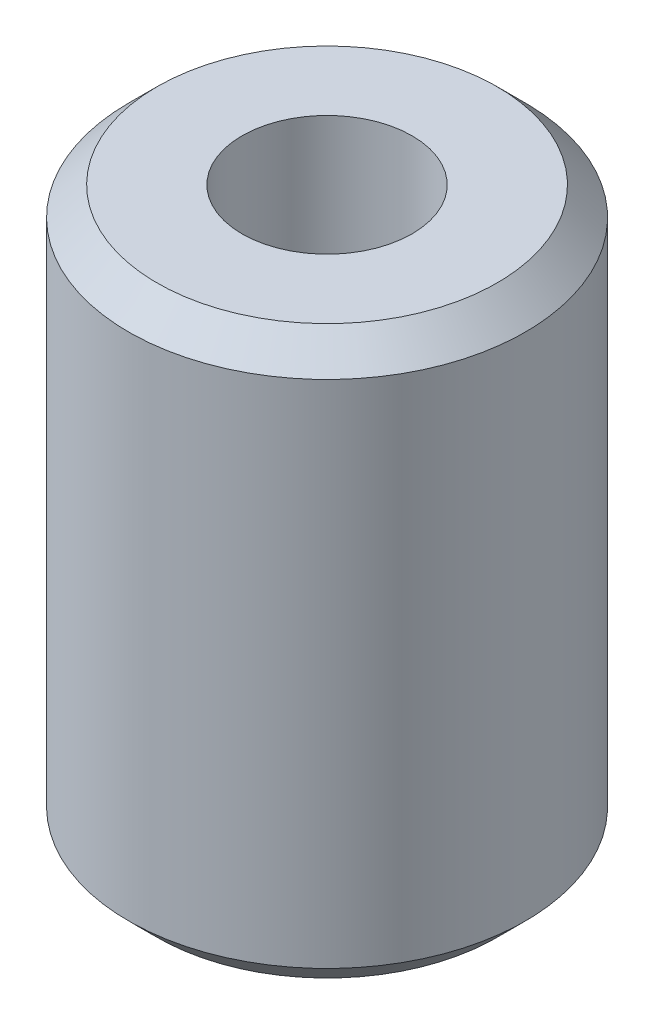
ISO-10303-21;
HEADER;
FILE_DESCRIPTION(('STEP AP214'),'2;1');
FILE_NAME('part.step','',(''),(''),'','','');
FILE_SCHEMA(('AUTOMOTIVE_DESIGN { 1 0 10303 214 1 1 1 1 }'));
ENDSEC;
DATA;
#1=APPLICATION_CONTEXT('core data for automotive mechanical design processes');
#2=APPLICATION_PROTOCOL_DEFINITION('international standard','automotive_design',2000,#1);
#3=PRODUCT_CONTEXT('',#1,'mechanical');
#4=PRODUCT('Part','Part','',(#3));
#5=PRODUCT_RELATED_PRODUCT_CATEGORY('part','',(#4));
#6=PRODUCT_DEFINITION_FORMATION('','',#4);
#7=PRODUCT_DEFINITION_CONTEXT('part definition',#1,'design');
#8=PRODUCT_DEFINITION('design','',#6,#7);
#9=PRODUCT_DEFINITION_SHAPE('','',#8);
#10=(LENGTH_UNIT() NAMED_UNIT(*) SI_UNIT(.MILLI.,.METRE.));
#11=(NAMED_UNIT(*) PLANE_ANGLE_UNIT() SI_UNIT($,.RADIAN.));
#12=(NAMED_UNIT(*) SI_UNIT($,.STERADIAN.) SOLID_ANGLE_UNIT());
#13=UNCERTAINTY_MEASURE_WITH_UNIT(LENGTH_MEASURE(1.E-05),#10,'distance_accuracy_value','');
#14=(GEOMETRIC_REPRESENTATION_CONTEXT(3) GLOBAL_UNCERTAINTY_ASSIGNED_CONTEXT((#13)) GLOBAL_UNIT_ASSIGNED_CONTEXT((#10,
#11,#12)) REPRESENTATION_CONTEXT('',''));
#15=CARTESIAN_POINT('',(0.,0.,0.));
#16=DIRECTION('',(0.,0.,1.));
#17=DIRECTION('',(1.,0.,0.));
#18=AXIS2_PLACEMENT_3D('',#15,#16,#17);
#19=CARTESIAN_POINT('',(1.5,5.,0.));
#20=DIRECTION('',(0.,-1.,0.));
#21=DIRECTION('',(1.,0.,0.));
#22=AXIS2_PLACEMENT_3D('',#19,#20,#21);
#23=PLANE('',#22);
#24=CARTESIAN_POINT('',(0.,5.,0.));
#25=DIRECTION('',(0.,1.,0.));
#26=DIRECTION('',(-1.,0.,0.));
#27=AXIS2_PLACEMENT_3D('',#24,#25,#26);
#28=CIRCLE('',#27,1.5);
#29=CARTESIAN_POINT('',(-1.50000000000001,5.,0.));
#30=VERTEX_POINT('',#29);
#31=EDGE_CURVE('E10',#30,#30,#28,.T.);
#32=ORIENTED_EDGE('',*,*,#31,.F.);
#33=EDGE_LOOP('',(#32));
#34=FACE_BOUND('',#33,.T.);
#35=CARTESIAN_POINT('',(0.,5.,0.));
#36=DIRECTION('',(0.,1.,0.));
#37=DIRECTION('',(-1.,0.,0.));
#38=AXIS2_PLACEMENT_3D('',#35,#36,#37);
#39=CIRCLE('',#38,3.);
#40=CARTESIAN_POINT('',(-3.,5.,0.));
#41=VERTEX_POINT('',#40);
#42=EDGE_CURVE('E66',#41,#41,#39,.T.);
#43=ORIENTED_EDGE('',*,*,#42,.T.);
#44=EDGE_LOOP('',(#43));
#45=FACE_BOUND('',#44,.T.);
#46=ADVANCED_FACE('F39',(#34,#45),#23,.F.);
#47=CARTESIAN_POINT('',(0.,5.,0.));
#48=DIRECTION('',(0.,1.,0.));
#49=DIRECTION('',(-1.,0.,0.));
#50=AXIS2_PLACEMENT_3D('',#47,#48,#49);
#51=CYLINDRICAL_SURFACE('',#50,1.5);
#52=CARTESIAN_POINT('',(0.,-5.,0.));
#53=DIRECTION('',(0.,1.,0.));
#54=DIRECTION('',(-1.,0.,0.));
#55=AXIS2_PLACEMENT_3D('',#52,#53,#54);
#56=CIRCLE('',#55,1.5);
#57=CARTESIAN_POINT('',(-1.5,-5.,0.));
#58=VERTEX_POINT('',#57);
#59=EDGE_CURVE('E46',#58,#58,#56,.T.);
#60=ORIENTED_EDGE('',*,*,#59,.F.);
#61=EDGE_LOOP('',(#60));
#62=FACE_BOUND('',#61,.T.);
#63=ORIENTED_EDGE('',*,*,#31,.T.);
#64=EDGE_LOOP('',(#63));
#65=FACE_BOUND('',#64,.T.);
#66=ADVANCED_FACE('F92',(#62,#65),#51,.F.);
#67=CARTESIAN_POINT('',(3.,-5.,0.));
#68=DIRECTION('',(0.,1.,0.));
#69=DIRECTION('',(-1.,0.,0.));
#70=AXIS2_PLACEMENT_3D('',#67,#68,#69);
#71=PLANE('',#70);
#72=CARTESIAN_POINT('',(0.,-5.,0.));
#73=DIRECTION('',(0.,1.,0.));
#74=DIRECTION('',(-1.,0.,0.));
#75=AXIS2_PLACEMENT_3D('',#72,#73,#74);
#76=CIRCLE('',#75,3.);
#77=CARTESIAN_POINT('',(-3.,-5.,0.));
#78=VERTEX_POINT('',#77);
#79=EDGE_CURVE('E51',#78,#78,#76,.T.);
#80=ORIENTED_EDGE('',*,*,#79,.F.);
#81=EDGE_LOOP('',(#80));
#82=FACE_BOUND('',#81,.T.);
#83=ORIENTED_EDGE('',*,*,#59,.T.);
#84=EDGE_LOOP('',(#83));
#85=FACE_BOUND('',#84,.T.);
#86=ADVANCED_FACE('F87',(#82,#85),#71,.F.);
#87=CARTESIAN_POINT('',(0.,-5.,0.));
#88=DIRECTION('',(0.,1.,0.));
#89=DIRECTION('',(-1.,0.,0.));
#90=AXIS2_PLACEMENT_3D('',#87,#88,#89);
#91=CONICAL_SURFACE('',#90,3.,0.785398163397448);
#92=CARTESIAN_POINT('',(0.,-4.5,0.));
#93=DIRECTION('',(0.,1.,0.));
#94=DIRECTION('',(-1.,0.,0.));
#95=AXIS2_PLACEMENT_3D('',#92,#93,#94);
#96=CIRCLE('',#95,3.5);
#97=CARTESIAN_POINT('',(-3.5,-4.5,0.));
#98=VERTEX_POINT('',#97);
#99=EDGE_CURVE('E56',#98,#98,#96,.T.);
#100=ORIENTED_EDGE('',*,*,#99,.F.);
#101=EDGE_LOOP('',(#100));
#102=FACE_BOUND('',#101,.T.);
#103=ORIENTED_EDGE('',*,*,#79,.T.);
#104=EDGE_LOOP('',(#103));
#105=FACE_BOUND('',#104,.T.);
#106=ADVANCED_FACE('F81',(#102,#105),#91,.T.);
#107=CARTESIAN_POINT('',(0.,5.,0.));
#108=DIRECTION('',(0.,1.,0.));
#109=DIRECTION('',(-1.,0.,0.));
#110=AXIS2_PLACEMENT_3D('',#107,#108,#109);
#111=CYLINDRICAL_SURFACE('',#110,3.5);
#112=CARTESIAN_POINT('',(0.,4.5,0.));
#113=DIRECTION('',(0.,1.,0.));
#114=DIRECTION('',(-1.,0.,0.));
#115=AXIS2_PLACEMENT_3D('',#112,#113,#114);
#116=CIRCLE('',#115,3.5);
#117=CARTESIAN_POINT('',(-3.5,4.5,0.));
#118=VERTEX_POINT('',#117);
#119=EDGE_CURVE('E62',#118,#118,#116,.T.);
#120=ORIENTED_EDGE('',*,*,#119,.F.);
#121=EDGE_LOOP('',(#120));
#122=FACE_BOUND('',#121,.T.);
#123=ORIENTED_EDGE('',*,*,#99,.T.);
#124=EDGE_LOOP('',(#123));
#125=FACE_BOUND('',#124,.T.);
#126=ADVANCED_FACE('F75',(#122,#125),#111,.T.);
#127=CARTESIAN_POINT('',(0.,4.5,0.));
#128=DIRECTION('',(0.,-1.,0.));
#129=DIRECTION('',(1.,0.,0.));
#130=AXIS2_PLACEMENT_3D('',#127,#128,#129);
#131=CONICAL_SURFACE('',#130,3.5,0.785398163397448);
#132=ORIENTED_EDGE('',*,*,#42,.F.);
#133=EDGE_LOOP('',(#132));
#134=FACE_BOUND('',#133,.T.);
#135=ORIENTED_EDGE('',*,*,#119,.T.);
#136=EDGE_LOOP('',(#135));
#137=FACE_BOUND('',#136,.T.);
#138=ADVANCED_FACE('F72',(#134,#137),#131,.T.);
#139=CLOSED_SHELL('',(#46,#66,#86,#106,#126,#138));
#140=MANIFOLD_SOLID_BREP('B2',#139);
#141=ADVANCED_BREP_SHAPE_REPRESENTATION('',(#18,#140),#14);
#142=SHAPE_DEFINITION_REPRESENTATION(#9,#141);
ENDSEC;
END-ISO-10303-21;
